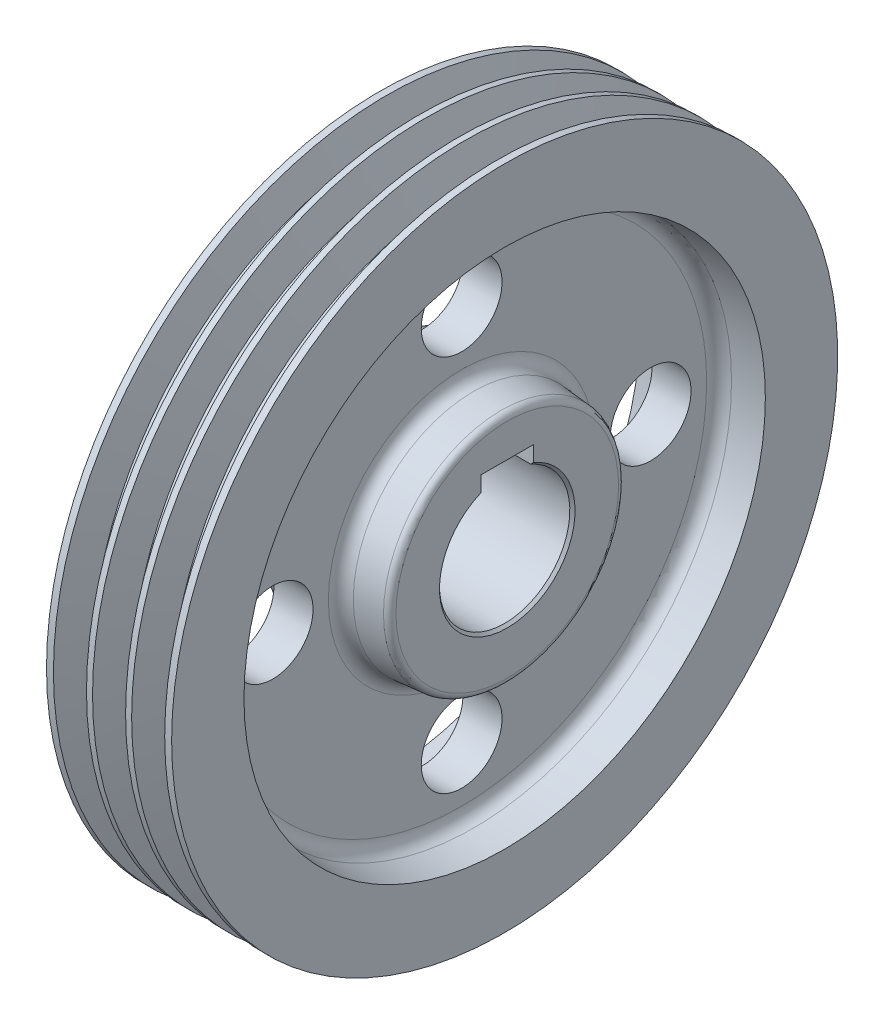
from build123d import *

# Parameters (mm, degrees)
PATTERN_LINEAR_1000_COUNT   = 3
PATTERN_LINEAR_1000_PITCH   = 15
CHAMFER_1_SIZE              = 1
SKETCH_4_W                  = 20
SKETCH_4_H                  = 6.987121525
CUT_EXTRUDE_1_DEPTH         = 188.456995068
FILLET_1_R                  = 5
FILLET_2_R                  = 2.5
SKETCH_5_R                  = 15.5
CUT_EXTRUDE_2_DEPTH         = 188.192748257
PATTERN_CIRCULAR_1827_COUNT = 4


with BuildPart() as part:
    # Sketch 1 → Revolve 1 (revolve)
    with BuildSketch(Plane.XY, mode=Mode.PRIVATE) as revolve_1_sk:
        Polygon((-1, 25), (-1, 45), (16.5, 46.531051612), (16.5, 98.556437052), (0, 100), (0, 127.75), (48, 127.75), (48, 100), (31.5, 98.556437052), (31.5, 46.531051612), (49, 45), (49, 25), align=None)
    revolve(revolve_1_sk.sketch.rotate(Axis((0, 0, 0), (1, 0, 0)), 90), axis=Axis((0, 0, 0), (1, 0, 0)))

    # Sketch 2 → Cut-Revolve 1 (revolve, cut)
    with BuildSketch(Plane.XY, mode=Mode.PRIVATE) as cut_revolve_1_sk:
        Polygon((11.840143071, 116.3), (15.340759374, 127.75), (2.659240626, 127.75), (6.159856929, 116.3), align=None)
    cut_revolve_1 = revolve(cut_revolve_1_sk.sketch.rotate(Axis((0, 0, 0), (1, 0, 0)), 90), axis=Axis((0, 0, 0), (1, 0, 0)), mode=Mode.SUBTRACT)

    # Pattern Linear 1000: Cut-Revolve 1 ×3
    with Locations(*[(i * PATTERN_LINEAR_1000_PITCH, 0, 0) for i in range(1, PATTERN_LINEAR_1000_COUNT)]):
        add(cut_revolve_1, mode=Mode.SUBTRACT)

    # Chamfer 1
    chamfer_1_edges = [part.edges().sort_by_distance(p)[0] for p in [
        (-1, 0, -25),
        (49, 0, -25),
    ]]
    chamfer(chamfer_1_edges, length=CHAMFER_1_SIZE)

    # Sketch 4 → Cut-Extrude 1 (cut, through all)
    with BuildSketch(Plane.ZY.offset(1)):
        with Locations((0, 26.406439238)):
            Rectangle(SKETCH_4_W, SKETCH_4_H)
    extrude(amount=-CUT_EXTRUDE_1_DEPTH, mode=Mode.SUBTRACT)

    # Fillet 1
    fillet_1_edges = [part.edges().sort_by_distance(p)[0] for p in [
        (16.5, 0, -98.556437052),
        (16.5, 0, -46.531051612),
        (31.5, 0, -46.531051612),
        (31.5, 0, -98.556437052),
    ]]
    fillet(fillet_1_edges, radius=FILLET_1_R)

    # Fillet 2
    fillet_2_edges = [part.edges().sort_by_distance(p)[0] for p in [
        (-1, 0, -45),
        (49, 0, -45),
    ]]
    fillet(fillet_2_edges, radius=FILLET_2_R)

    # Sketch 5 → Cut-Extrude 2 (cut, through all)
    with BuildSketch(Plane(origin=(0, 0, 0), x_dir=(0, 0, -1), z_dir=(1, 0, 0))):
        with Locations(Location((0, 72.5, 0), (0, 0, 180))):
            Circle(SKETCH_5_R)
    cut_extrude_2 = extrude(amount=CUT_EXTRUDE_2_DEPTH, mode=Mode.SUBTRACT)

    # Pattern Circular 1827: Cut-Extrude 2 ×4 about axis
    pattern_circular_1827_axis = Axis((0, 0, 0), (1, 0, 0))
    for i in range(1, PATTERN_CIRCULAR_1827_COUNT):
        add(cut_extrude_2.rotate(pattern_circular_1827_axis, i * 360 / PATTERN_CIRCULAR_1827_COUNT), mode=Mode.SUBTRACT)


solid = part.part
